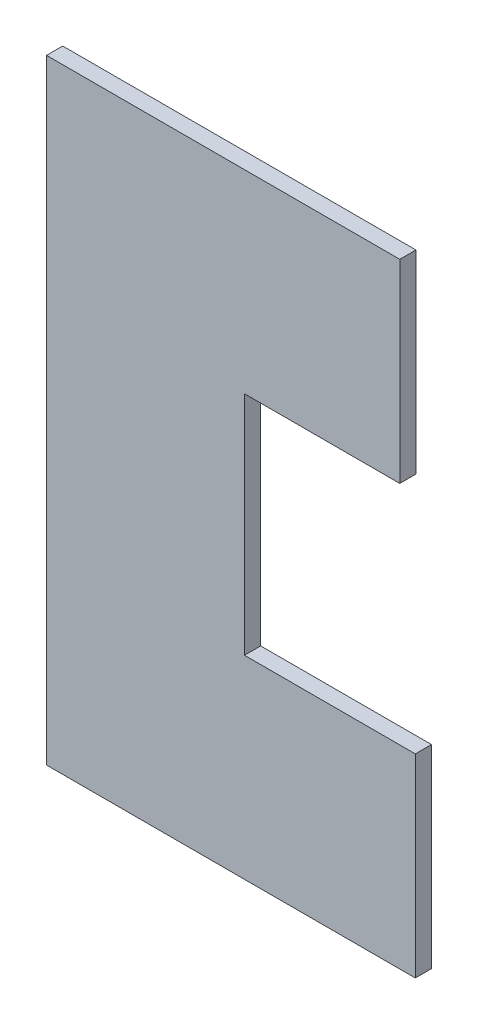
ISO-10303-21;
HEADER;
FILE_DESCRIPTION(('STEP AP214'),'2;1');
FILE_NAME('part.step','',(''),(''),'','','');
FILE_SCHEMA(('AUTOMOTIVE_DESIGN { 1 0 10303 214 1 1 1 1 }'));
ENDSEC;
DATA;
#1=APPLICATION_CONTEXT('core data for automotive mechanical design processes');
#2=APPLICATION_PROTOCOL_DEFINITION('international standard','automotive_design',2000,#1);
#3=PRODUCT_CONTEXT('',#1,'mechanical');
#4=PRODUCT('Part','Part','',(#3));
#5=PRODUCT_RELATED_PRODUCT_CATEGORY('part','',(#4));
#6=PRODUCT_DEFINITION_FORMATION('','',#4);
#7=PRODUCT_DEFINITION_CONTEXT('part definition',#1,'design');
#8=PRODUCT_DEFINITION('design','',#6,#7);
#9=PRODUCT_DEFINITION_SHAPE('','',#8);
#10=(LENGTH_UNIT() NAMED_UNIT(*) SI_UNIT(.MILLI.,.METRE.));
#11=(NAMED_UNIT(*) PLANE_ANGLE_UNIT() SI_UNIT($,.RADIAN.));
#12=(NAMED_UNIT(*) SI_UNIT($,.STERADIAN.) SOLID_ANGLE_UNIT());
#13=UNCERTAINTY_MEASURE_WITH_UNIT(LENGTH_MEASURE(1.E-05),#10,'distance_accuracy_value','');
#14=(GEOMETRIC_REPRESENTATION_CONTEXT(3) GLOBAL_UNCERTAINTY_ASSIGNED_CONTEXT((#13)) GLOBAL_UNIT_ASSIGNED_CONTEXT((#10,
#11,#12)) REPRESENTATION_CONTEXT('',''));
#15=CARTESIAN_POINT('',(0.,0.,0.));
#16=DIRECTION('',(0.,0.,1.));
#17=DIRECTION('',(1.,0.,0.));
#18=AXIS2_PLACEMENT_3D('',#15,#16,#17);
#19=CARTESIAN_POINT('',(0.,475.,12.5));
#20=DIRECTION('',(1.,0.,0.));
#21=DIRECTION('',(0.,1.,0.));
#22=AXIS2_PLACEMENT_3D('',#19,#20,#21);
#23=PLANE('',#22);
#24=DIRECTION('',(0.,-1.,0.));
#25=VECTOR('',#24,1.);
#26=CARTESIAN_POINT('',(0.,475.,0.));
#27=LINE('',#26,#25);
#28=CARTESIAN_POINT('',(0.,475.,0.));
#29=VERTEX_POINT('',#28);
#30=CARTESIAN_POINT('',(0.,0.,0.));
#31=VERTEX_POINT('',#30);
#32=EDGE_CURVE('E97',#29,#31,#27,.T.);
#33=ORIENTED_EDGE('',*,*,#32,.T.);
#34=DIRECTION('',(0.,0.,-1.));
#35=VECTOR('',#34,1.);
#36=CARTESIAN_POINT('',(0.,0.,12.5));
#37=LINE('',#36,#35);
#38=CARTESIAN_POINT('',(0.,0.,12.5));
#39=VERTEX_POINT('',#38);
#40=EDGE_CURVE('E11',#39,#31,#37,.T.);
#41=ORIENTED_EDGE('',*,*,#40,.F.);
#42=DIRECTION('',(0.,-1.,0.));
#43=VECTOR('',#42,1.);
#44=CARTESIAN_POINT('',(0.,475.,12.5));
#45=LINE('',#44,#43);
#46=CARTESIAN_POINT('',(0.,475.,12.5));
#47=VERTEX_POINT('',#46);
#48=EDGE_CURVE('E124',#47,#39,#45,.T.);
#49=ORIENTED_EDGE('',*,*,#48,.F.);
#50=DIRECTION('',(0.,0.,-1.));
#51=VECTOR('',#50,1.);
#52=CARTESIAN_POINT('',(0.,475.,12.5));
#53=LINE('',#52,#51);
#54=EDGE_CURVE('E110',#47,#29,#53,.T.);
#55=ORIENTED_EDGE('',*,*,#54,.T.);
#56=EDGE_LOOP('',(#33,#41,#49,#55));
#57=FACE_BOUND('',#56,.T.);
#58=ADVANCED_FACE('F29',(#57),#23,.F.);
#59=CARTESIAN_POINT('',(0.,0.,12.5));
#60=DIRECTION('',(0.,1.,0.));
#61=DIRECTION('',(0.,0.,1.));
#62=AXIS2_PLACEMENT_3D('',#59,#60,#61);
#63=PLANE('',#62);
#64=DIRECTION('',(1.,0.,0.));
#65=VECTOR('',#64,1.);
#66=CARTESIAN_POINT('',(0.,0.,0.));
#67=LINE('',#66,#65);
#68=CARTESIAN_POINT('',(285.,0.,0.));
#69=VERTEX_POINT('',#68);
#70=EDGE_CURVE('E93',#31,#69,#67,.T.);
#71=ORIENTED_EDGE('',*,*,#70,.T.);
#72=DIRECTION('',(0.,0.,-1.));
#73=VECTOR('',#72,1.);
#74=CARTESIAN_POINT('',(285.,0.,12.5));
#75=LINE('',#74,#73);
#76=CARTESIAN_POINT('',(285.,0.,12.5));
#77=VERTEX_POINT('',#76);
#78=EDGE_CURVE('E36',#77,#69,#75,.T.);
#79=ORIENTED_EDGE('',*,*,#78,.F.);
#80=DIRECTION('',(1.,0.,0.));
#81=VECTOR('',#80,1.);
#82=CARTESIAN_POINT('',(0.,0.,12.5));
#83=LINE('',#82,#81);
#84=EDGE_CURVE('E106',#39,#77,#83,.T.);
#85=ORIENTED_EDGE('',*,*,#84,.F.);
#86=ORIENTED_EDGE('',*,*,#40,.T.);
#87=EDGE_LOOP('',(#71,#79,#85,#86));
#88=FACE_BOUND('',#87,.T.);
#89=ADVANCED_FACE('F105',(#88),#63,.F.);
#90=CARTESIAN_POINT('',(285.,0.,12.5));
#91=DIRECTION('',(-1.,0.,0.));
#92=DIRECTION('',(0.,0.,1.));
#93=AXIS2_PLACEMENT_3D('',#90,#91,#92);
#94=PLANE('',#93);
#95=DIRECTION('',(0.,1.,0.));
#96=VECTOR('',#95,1.);
#97=CARTESIAN_POINT('',(285.,0.,0.));
#98=LINE('',#97,#96);
#99=CARTESIAN_POINT('',(285.,150.,0.));
#100=VERTEX_POINT('',#99);
#101=EDGE_CURVE('E99',#69,#100,#98,.T.);
#102=ORIENTED_EDGE('',*,*,#101,.T.);
#103=DIRECTION('',(0.,0.,-1.));
#104=VECTOR('',#103,1.);
#105=CARTESIAN_POINT('',(285.,150.,12.5));
#106=LINE('',#105,#104);
#107=CARTESIAN_POINT('',(285.,150.,12.5));
#108=VERTEX_POINT('',#107);
#109=EDGE_CURVE('E150',#108,#100,#106,.T.);
#110=ORIENTED_EDGE('',*,*,#109,.F.);
#111=DIRECTION('',(0.,1.,0.));
#112=VECTOR('',#111,1.);
#113=CARTESIAN_POINT('',(285.,0.,12.5));
#114=LINE('',#113,#112);
#115=EDGE_CURVE('E127',#77,#108,#114,.T.);
#116=ORIENTED_EDGE('',*,*,#115,.F.);
#117=ORIENTED_EDGE('',*,*,#78,.T.);
#118=EDGE_LOOP('',(#102,#110,#116,#117));
#119=FACE_BOUND('',#118,.T.);
#120=ADVANCED_FACE('F154',(#119),#94,.F.);
#121=CARTESIAN_POINT('',(285.,150.,12.5));
#122=DIRECTION('',(0.,-1.,0.));
#123=DIRECTION('',(1.,0.,0.));
#124=AXIS2_PLACEMENT_3D('',#121,#122,#123);
#125=PLANE('',#124);
#126=DIRECTION('',(-1.,0.,0.));
#127=VECTOR('',#126,1.);
#128=CARTESIAN_POINT('',(285.,150.,0.));
#129=LINE('',#128,#127);
#130=CARTESIAN_POINT('',(153.,150.,0.));
#131=VERTEX_POINT('',#130);
#132=EDGE_CURVE('E114',#100,#131,#129,.T.);
#133=ORIENTED_EDGE('',*,*,#132,.T.);
#134=DIRECTION('',(0.,0.,-1.));
#135=VECTOR('',#134,1.);
#136=CARTESIAN_POINT('',(153.,150.,12.5));
#137=LINE('',#136,#135);
#138=CARTESIAN_POINT('',(153.,150.,12.5));
#139=VERTEX_POINT('',#138);
#140=EDGE_CURVE('E147',#139,#131,#137,.T.);
#141=ORIENTED_EDGE('',*,*,#140,.F.);
#142=DIRECTION('',(-1.,0.,0.));
#143=VECTOR('',#142,1.);
#144=CARTESIAN_POINT('',(285.,150.,12.5));
#145=LINE('',#144,#143);
#146=EDGE_CURVE('E129',#108,#139,#145,.T.);
#147=ORIENTED_EDGE('',*,*,#146,.F.);
#148=ORIENTED_EDGE('',*,*,#109,.T.);
#149=EDGE_LOOP('',(#133,#141,#147,#148));
#150=FACE_BOUND('',#149,.T.);
#151=ADVANCED_FACE('F162',(#150),#125,.F.);
#152=CARTESIAN_POINT('',(153.,150.,12.5));
#153=DIRECTION('',(-1.,0.,0.));
#154=DIRECTION('',(0.,0.,1.));
#155=AXIS2_PLACEMENT_3D('',#152,#153,#154);
#156=PLANE('',#155);
#157=DIRECTION('',(0.,1.,0.));
#158=VECTOR('',#157,1.);
#159=CARTESIAN_POINT('',(153.,150.,0.));
#160=LINE('',#159,#158);
#161=CARTESIAN_POINT('',(153.,325.,0.));
#162=VERTEX_POINT('',#161);
#163=EDGE_CURVE('E116',#131,#162,#160,.T.);
#164=ORIENTED_EDGE('',*,*,#163,.T.);
#165=DIRECTION('',(0.,0.,-1.));
#166=VECTOR('',#165,1.);
#167=CARTESIAN_POINT('',(153.,325.,12.5));
#168=LINE('',#167,#166);
#169=CARTESIAN_POINT('',(153.,325.,12.5));
#170=VERTEX_POINT('',#169);
#171=EDGE_CURVE('E144',#170,#162,#168,.T.);
#172=ORIENTED_EDGE('',*,*,#171,.F.);
#173=DIRECTION('',(0.,1.,0.));
#174=VECTOR('',#173,1.);
#175=CARTESIAN_POINT('',(153.,150.,12.5));
#176=LINE('',#175,#174);
#177=EDGE_CURVE('E131',#139,#170,#176,.T.);
#178=ORIENTED_EDGE('',*,*,#177,.F.);
#179=ORIENTED_EDGE('',*,*,#140,.T.);
#180=EDGE_LOOP('',(#164,#172,#178,#179));
#181=FACE_BOUND('',#180,.T.);
#182=ADVANCED_FACE('F165',(#181),#156,.F.);
#183=CARTESIAN_POINT('',(153.,325.,12.5));
#184=DIRECTION('',(0.,1.,0.));
#185=DIRECTION('',(0.,0.,1.));
#186=AXIS2_PLACEMENT_3D('',#183,#184,#185);
#187=PLANE('',#186);
#188=DIRECTION('',(1.,0.,0.));
#189=VECTOR('',#188,1.);
#190=CARTESIAN_POINT('',(153.,325.,0.));
#191=LINE('',#190,#189);
#192=CARTESIAN_POINT('',(273.,325.,0.));
#193=VERTEX_POINT('',#192);
#194=EDGE_CURVE('E118',#162,#193,#191,.T.);
#195=ORIENTED_EDGE('',*,*,#194,.T.);
#196=DIRECTION('',(0.,0.,-1.));
#197=VECTOR('',#196,1.);
#198=CARTESIAN_POINT('',(273.,325.,12.5));
#199=LINE('',#198,#197);
#200=CARTESIAN_POINT('',(273.,325.,12.5));
#201=VERTEX_POINT('',#200);
#202=EDGE_CURVE('E141',#201,#193,#199,.T.);
#203=ORIENTED_EDGE('',*,*,#202,.F.);
#204=DIRECTION('',(1.,0.,0.));
#205=VECTOR('',#204,1.);
#206=CARTESIAN_POINT('',(153.,325.,12.5));
#207=LINE('',#206,#205);
#208=EDGE_CURVE('E133',#170,#201,#207,.T.);
#209=ORIENTED_EDGE('',*,*,#208,.F.);
#210=ORIENTED_EDGE('',*,*,#171,.T.);
#211=EDGE_LOOP('',(#195,#203,#209,#210));
#212=FACE_BOUND('',#211,.T.);
#213=ADVANCED_FACE('F170',(#212),#187,.F.);
#214=CARTESIAN_POINT('',(273.,325.,12.5));
#215=DIRECTION('',(-1.,0.,0.));
#216=DIRECTION('',(0.,-1.,0.));
#217=AXIS2_PLACEMENT_3D('',#214,#215,#216);
#218=PLANE('',#217);
#219=DIRECTION('',(0.,1.,0.));
#220=VECTOR('',#219,1.);
#221=CARTESIAN_POINT('',(273.,325.,0.));
#222=LINE('',#221,#220);
#223=CARTESIAN_POINT('',(273.,475.,0.));
#224=VERTEX_POINT('',#223);
#225=EDGE_CURVE('E120',#193,#224,#222,.T.);
#226=ORIENTED_EDGE('',*,*,#225,.T.);
#227=DIRECTION('',(0.,0.,-1.));
#228=VECTOR('',#227,1.);
#229=CARTESIAN_POINT('',(273.,475.,12.5));
#230=LINE('',#229,#228);
#231=CARTESIAN_POINT('',(273.,475.,12.5));
#232=VERTEX_POINT('',#231);
#233=EDGE_CURVE('E138',#232,#224,#230,.T.);
#234=ORIENTED_EDGE('',*,*,#233,.F.);
#235=DIRECTION('',(0.,1.,0.));
#236=VECTOR('',#235,1.);
#237=CARTESIAN_POINT('',(273.,325.,12.5));
#238=LINE('',#237,#236);
#239=EDGE_CURVE('E48',#201,#232,#238,.T.);
#240=ORIENTED_EDGE('',*,*,#239,.F.);
#241=ORIENTED_EDGE('',*,*,#202,.T.);
#242=EDGE_LOOP('',(#226,#234,#240,#241));
#243=FACE_BOUND('',#242,.T.);
#244=ADVANCED_FACE('F173',(#243),#218,.F.);
#245=CARTESIAN_POINT('',(273.,475.,12.5));
#246=DIRECTION('',(0.,-1.,0.));
#247=DIRECTION('',(1.,0.,0.));
#248=AXIS2_PLACEMENT_3D('',#245,#246,#247);
#249=PLANE('',#248);
#250=DIRECTION('',(-1.,0.,0.));
#251=VECTOR('',#250,1.);
#252=CARTESIAN_POINT('',(273.,475.,0.));
#253=LINE('',#252,#251);
#254=EDGE_CURVE('E122',#224,#29,#253,.T.);
#255=ORIENTED_EDGE('',*,*,#254,.T.);
#256=ORIENTED_EDGE('',*,*,#54,.F.);
#257=DIRECTION('',(-1.,0.,0.));
#258=VECTOR('',#257,1.);
#259=CARTESIAN_POINT('',(273.,475.,12.5));
#260=LINE('',#259,#258);
#261=EDGE_CURVE('E43',#232,#47,#260,.T.);
#262=ORIENTED_EDGE('',*,*,#261,.F.);
#263=ORIENTED_EDGE('',*,*,#233,.T.);
#264=EDGE_LOOP('',(#255,#256,#262,#263));
#265=FACE_BOUND('',#264,.T.);
#266=ADVANCED_FACE('F175',(#265),#249,.F.);
#267=CARTESIAN_POINT('',(0.,0.,12.5));
#268=DIRECTION('',(0.,0.,1.));
#269=DIRECTION('',(1.,0.,0.));
#270=AXIS2_PLACEMENT_3D('',#267,#268,#269);
#271=PLANE('',#270);
#272=ORIENTED_EDGE('',*,*,#48,.T.);
#273=ORIENTED_EDGE('',*,*,#84,.T.);
#274=ORIENTED_EDGE('',*,*,#115,.T.);
#275=ORIENTED_EDGE('',*,*,#146,.T.);
#276=ORIENTED_EDGE('',*,*,#177,.T.);
#277=ORIENTED_EDGE('',*,*,#208,.T.);
#278=ORIENTED_EDGE('',*,*,#239,.T.);
#279=ORIENTED_EDGE('',*,*,#261,.T.);
#280=EDGE_LOOP('',(#272,#273,#274,#275,#276,#277,#278,#279));
#281=FACE_BOUND('',#280,.T.);
#282=ADVANCED_FACE('F157',(#281),#271,.T.);
#283=CARTESIAN_POINT('',(0.,0.,0.));
#284=DIRECTION('',(0.,0.,1.));
#285=DIRECTION('',(1.,0.,0.));
#286=AXIS2_PLACEMENT_3D('',#283,#284,#285);
#287=PLANE('',#286);
#288=ORIENTED_EDGE('',*,*,#32,.F.);
#289=ORIENTED_EDGE('',*,*,#254,.F.);
#290=ORIENTED_EDGE('',*,*,#225,.F.);
#291=ORIENTED_EDGE('',*,*,#194,.F.);
#292=ORIENTED_EDGE('',*,*,#163,.F.);
#293=ORIENTED_EDGE('',*,*,#132,.F.);
#294=ORIENTED_EDGE('',*,*,#101,.F.);
#295=ORIENTED_EDGE('',*,*,#70,.F.);
#296=EDGE_LOOP('',(#288,#289,#290,#291,#292,#293,#294,#295));
#297=FACE_BOUND('',#296,.T.);
#298=ADVANCED_FACE('F94',(#297),#287,.F.);
#299=CLOSED_SHELL('',(#58,#89,#120,#151,#182,#213,#244,#266,#282,#298));
#300=MANIFOLD_SOLID_BREP('B2',#299);
#301=ADVANCED_BREP_SHAPE_REPRESENTATION('',(#18,#300),#14);
#302=SHAPE_DEFINITION_REPRESENTATION(#9,#301);
ENDSEC;
END-ISO-10303-21;
